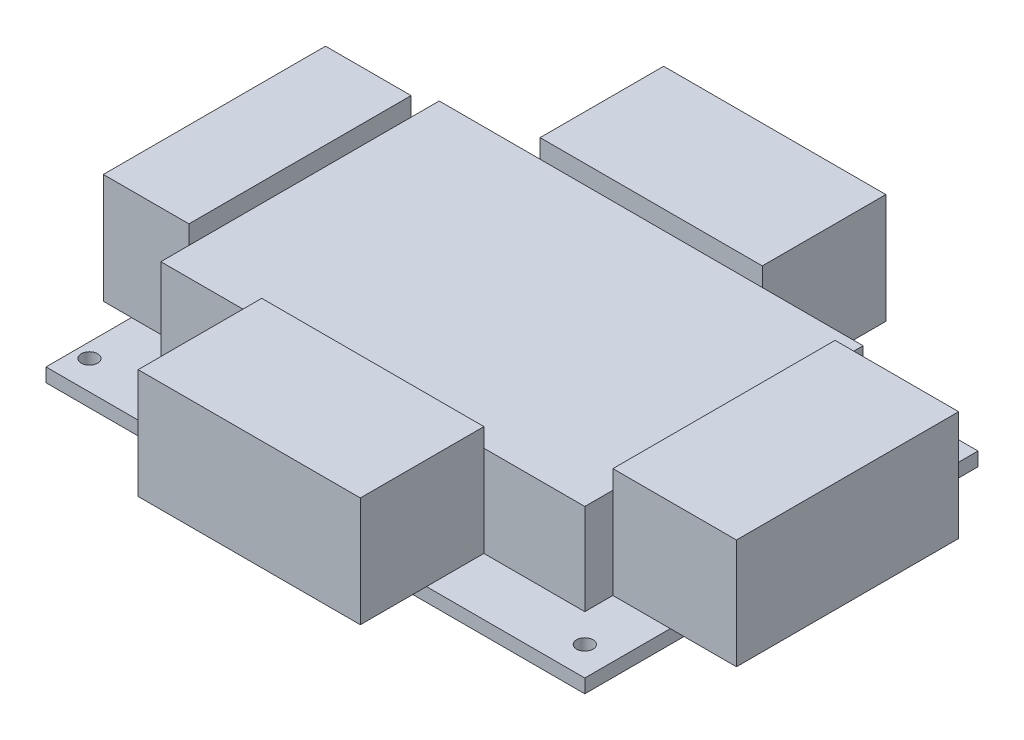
ISO-10303-21;
HEADER;
FILE_DESCRIPTION(('STEP AP214'),'2;1');
FILE_NAME('part.step','',(''),(''),'','','');
FILE_SCHEMA(('AUTOMOTIVE_DESIGN { 1 0 10303 214 1 1 1 1 }'));
ENDSEC;
DATA;
#1=APPLICATION_CONTEXT('core data for automotive mechanical design processes');
#2=APPLICATION_PROTOCOL_DEFINITION('international standard','automotive_design',2000,#1);
#3=PRODUCT_CONTEXT('',#1,'mechanical');
#4=PRODUCT('Part','Part','',(#3));
#5=PRODUCT_RELATED_PRODUCT_CATEGORY('part','',(#4));
#6=PRODUCT_DEFINITION_FORMATION('','',#4);
#7=PRODUCT_DEFINITION_CONTEXT('part definition',#1,'design');
#8=PRODUCT_DEFINITION('design','',#6,#7);
#9=PRODUCT_DEFINITION_SHAPE('','',#8);
#10=(LENGTH_UNIT() NAMED_UNIT(*) SI_UNIT(.MILLI.,.METRE.));
#11=(NAMED_UNIT(*) PLANE_ANGLE_UNIT() SI_UNIT($,.RADIAN.));
#12=(NAMED_UNIT(*) SI_UNIT($,.STERADIAN.) SOLID_ANGLE_UNIT());
#13=UNCERTAINTY_MEASURE_WITH_UNIT(LENGTH_MEASURE(1.E-05),#10,'distance_accuracy_value','');
#14=(GEOMETRIC_REPRESENTATION_CONTEXT(3) GLOBAL_UNCERTAINTY_ASSIGNED_CONTEXT((#13)) GLOBAL_UNIT_ASSIGNED_CONTEXT((#10,
#11,#12)) REPRESENTATION_CONTEXT('',''));
#15=CARTESIAN_POINT('',(0.,0.,0.));
#16=DIRECTION('',(0.,0.,1.));
#17=DIRECTION('',(1.,0.,0.));
#18=AXIS2_PLACEMENT_3D('',#15,#16,#17);
#19=CARTESIAN_POINT('',(0.,2.794,0.));
#20=DIRECTION('',(0.,-1.,0.));
#21=DIRECTION('',(0.,0.,-1.));
#22=AXIS2_PLACEMENT_3D('',#19,#20,#21);
#23=PLANE('',#22);
#24=CARTESIAN_POINT('',(2.92735,2.794,-74.09815));
#25=DIRECTION('',(0.,1.,0.));
#26=DIRECTION('',(0.,0.,1.));
#27=AXIS2_PLACEMENT_3D('',#24,#25,#26);
#28=CIRCLE('',#27,1.67005);
#29=CARTESIAN_POINT('',(2.92735,2.794,-72.4281));
#30=VERTEX_POINT('',#29);
#31=EDGE_CURVE('E433',#30,#30,#28,.T.);
#32=ORIENTED_EDGE('',*,*,#31,.F.);
#33=EDGE_LOOP('',(#32));
#34=FACE_BOUND('',#33,.T.);
#35=DIRECTION('',(0.,0.,1.));
#36=VECTOR('',#35,1.);
#37=CARTESIAN_POINT('',(32.21355,2.794,-68.326));
#38=LINE('',#37,#36);
#39=CARTESIAN_POINT('',(32.21355,2.794,-80.01));
#40=VERTEX_POINT('',#39);
#41=CARTESIAN_POINT('',(32.21355,2.794,-68.326));
#42=VERTEX_POINT('',#41);
#43=EDGE_CURVE('E509',#40,#42,#38,.T.);
#44=ORIENTED_EDGE('',*,*,#43,.F.);
#45=DIRECTION('',(-1.,0.,0.));
#46=VECTOR('',#45,1.);
#47=CARTESIAN_POINT('',(0.,2.794,-80.01));
#48=LINE('',#47,#46);
#49=CARTESIAN_POINT('',(0.,2.794,-80.01));
#50=VERTEX_POINT('',#49);
#51=EDGE_CURVE('E463',#40,#50,#48,.T.);
#52=ORIENTED_EDGE('',*,*,#51,.T.);
#53=DIRECTION('',(0.,0.,1.));
#54=VECTOR('',#53,1.);
#55=CARTESIAN_POINT('',(0.,2.794,0.));
#56=LINE('',#55,#54);
#57=CARTESIAN_POINT('',(0.,2.794,-62.611));
#58=VERTEX_POINT('',#57);
#59=EDGE_CURVE('E451',#50,#58,#56,.T.);
#60=ORIENTED_EDGE('',*,*,#59,.T.);
#61=DIRECTION('',(-1.,0.,0.));
#62=VECTOR('',#61,1.);
#63=CARTESIAN_POINT('',(11.684,2.794,-62.611));
#64=LINE('',#63,#62);
#65=CARTESIAN_POINT('',(11.684,2.794,-62.611));
#66=VERTEX_POINT('',#65);
#67=EDGE_CURVE('E286',#66,#58,#64,.T.);
#68=ORIENTED_EDGE('',*,*,#67,.F.);
#69=DIRECTION('',(0.,0.,1.));
#70=VECTOR('',#69,1.);
#71=CARTESIAN_POINT('',(11.684,2.794,-11.684));
#72=LINE('',#71,#70);
#73=CARTESIAN_POINT('',(11.684,2.794,-68.326));
#74=VERTEX_POINT('',#73);
#75=EDGE_CURVE('E400',#74,#66,#72,.T.);
#76=ORIENTED_EDGE('',*,*,#75,.F.);
#77=DIRECTION('',(-1.,0.,0.));
#78=VECTOR('',#77,1.);
#79=CARTESIAN_POINT('',(11.684,2.794,-68.326));
#80=LINE('',#79,#78);
#81=EDGE_CURVE('E411',#42,#74,#80,.T.);
#82=ORIENTED_EDGE('',*,*,#81,.F.);
#83=EDGE_LOOP('',(#44,#52,#60,#68,#76,#82));
#84=FACE_BOUND('',#83,.T.);
#85=ADVANCED_FACE('F35',(#34,#84),#23,.F.);
#86=CARTESIAN_POINT('',(103.72725,2.794,-74.09815));
#87=DIRECTION('',(0.,1.,0.));
#88=DIRECTION('',(0.,0.,1.));
#89=AXIS2_PLACEMENT_3D('',#86,#87,#88);
#90=CIRCLE('',#89,1.67005000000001);
#91=CARTESIAN_POINT('',(103.72725,2.794,-72.4281));
#92=VERTEX_POINT('',#91);
#93=EDGE_CURVE('E439',#92,#92,#90,.T.);
#94=ORIENTED_EDGE('',*,*,#93,.F.);
#95=EDGE_LOOP('',(#94));
#96=FACE_BOUND('',#95,.T.);
#97=DIRECTION('',(0.,0.,-1.));
#98=VECTOR('',#97,1.);
#99=CARTESIAN_POINT('',(77.42555,2.794,-68.326));
#100=LINE('',#99,#98);
#101=CARTESIAN_POINT('',(77.42555,2.794,-68.326));
#102=VERTEX_POINT('',#101);
#103=CARTESIAN_POINT('',(77.42555,2.794,-80.01));
#104=VERTEX_POINT('',#103);
#105=EDGE_CURVE('E517',#102,#104,#100,.T.);
#106=ORIENTED_EDGE('',*,*,#105,.F.);
#107=CARTESIAN_POINT('',(97.9551,2.794,-68.326));
#108=VERTEX_POINT('',#107);
#109=EDGE_CURVE('E412',#108,#102,#80,.T.);
#110=ORIENTED_EDGE('',*,*,#109,.F.);
#111=DIRECTION('',(0.,0.,-1.));
#112=VECTOR('',#111,1.);
#113=CARTESIAN_POINT('',(97.9551,2.794,-11.684));
#114=LINE('',#113,#112);
#115=CARTESIAN_POINT('',(97.9551,2.794,-62.611));
#116=VERTEX_POINT('',#115);
#117=EDGE_CURVE('E407',#116,#108,#114,.T.);
#118=ORIENTED_EDGE('',*,*,#117,.F.);
#119=DIRECTION('',(-1.,0.,0.));
#120=VECTOR('',#119,1.);
#121=CARTESIAN_POINT('',(123.1011,2.794,-62.611));
#122=LINE('',#121,#120);
#123=CARTESIAN_POINT('',(109.6391,2.794,-62.611));
#124=VERTEX_POINT('',#123);
#125=EDGE_CURVE('E356',#124,#116,#122,.T.);
#126=ORIENTED_EDGE('',*,*,#125,.F.);
#127=DIRECTION('',(0.,0.,-1.));
#128=VECTOR('',#127,1.);
#129=CARTESIAN_POINT('',(109.6391,2.794,0.));
#130=LINE('',#129,#128);
#131=CARTESIAN_POINT('',(109.6391,2.794,-80.01));
#132=VERTEX_POINT('',#131);
#133=EDGE_CURVE('E459',#124,#132,#130,.T.);
#134=ORIENTED_EDGE('',*,*,#133,.T.);
#135=EDGE_CURVE('E464',#132,#104,#48,.T.);
#136=ORIENTED_EDGE('',*,*,#135,.T.);
#137=EDGE_LOOP('',(#106,#110,#118,#126,#134,#136));
#138=FACE_BOUND('',#137,.T.);
#139=ADVANCED_FACE('F514',(#96,#138),#23,.F.);
#140=CARTESIAN_POINT('',(11.684,21.336,-68.326));
#141=DIRECTION('',(0.,0.,1.));
#142=DIRECTION('',(1.,0.,0.));
#143=AXIS2_PLACEMENT_3D('',#140,#141,#142);
#144=PLANE('',#143);
#145=DIRECTION('',(0.,-1.,0.));
#146=VECTOR('',#145,1.);
#147=CARTESIAN_POINT('',(32.21355,25.146,-68.326));
#148=LINE('',#147,#146);
#149=CARTESIAN_POINT('',(32.21355,21.336,-68.326));
#150=VERTEX_POINT('',#149);
#151=EDGE_CURVE('E265',#150,#42,#148,.T.);
#152=ORIENTED_EDGE('',*,*,#151,.T.);
#153=ORIENTED_EDGE('',*,*,#81,.T.);
#154=DIRECTION('',(0.,-1.,0.));
#155=VECTOR('',#154,1.);
#156=CARTESIAN_POINT('',(11.684,21.336,-68.326));
#157=LINE('',#156,#155);
#158=CARTESIAN_POINT('',(11.684,21.336,-68.326));
#159=VERTEX_POINT('',#158);
#160=EDGE_CURVE('E398',#159,#74,#157,.T.);
#161=ORIENTED_EDGE('',*,*,#160,.F.);
#162=DIRECTION('',(-1.,0.,0.));
#163=VECTOR('',#162,1.);
#164=CARTESIAN_POINT('',(11.684,21.336,-68.326));
#165=LINE('',#164,#163);
#166=EDGE_CURVE('E393',#150,#159,#165,.T.);
#167=ORIENTED_EDGE('',*,*,#166,.F.);
#168=EDGE_LOOP('',(#152,#153,#161,#167));
#169=FACE_BOUND('',#168,.T.);
#170=ADVANCED_FACE('F561',(#169),#144,.F.);
#171=DIRECTION('',(0.,-1.,0.));
#172=VECTOR('',#171,1.);
#173=CARTESIAN_POINT('',(77.42555,25.146,-68.326));
#174=LINE('',#173,#172);
#175=CARTESIAN_POINT('',(77.42555,21.336,-68.326));
#176=VERTEX_POINT('',#175);
#177=EDGE_CURVE('E567',#176,#102,#174,.T.);
#178=ORIENTED_EDGE('',*,*,#177,.F.);
#179=CARTESIAN_POINT('',(97.9551,21.336,-68.326));
#180=VERTEX_POINT('',#179);
#181=EDGE_CURVE('E395',#180,#176,#165,.T.);
#182=ORIENTED_EDGE('',*,*,#181,.F.);
#183=DIRECTION('',(0.,-1.,0.));
#184=VECTOR('',#183,1.);
#185=CARTESIAN_POINT('',(97.9551,21.336,-68.326));
#186=LINE('',#185,#184);
#187=EDGE_CURVE('E417',#180,#108,#186,.T.);
#188=ORIENTED_EDGE('',*,*,#187,.T.);
#189=ORIENTED_EDGE('',*,*,#109,.T.);
#190=EDGE_LOOP('',(#178,#182,#188,#189));
#191=FACE_BOUND('',#190,.T.);
#192=ADVANCED_FACE('F570',(#191),#144,.F.);
#193=CARTESIAN_POINT('',(2.92735,2.794,-5.91185000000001));
#194=DIRECTION('',(0.,1.,0.));
#195=DIRECTION('',(0.,0.,1.));
#196=AXIS2_PLACEMENT_3D('',#193,#194,#195);
#197=CIRCLE('',#196,1.67005);
#198=CARTESIAN_POINT('',(2.92735,2.794,-4.24180000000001));
#199=VERTEX_POINT('',#198);
#200=EDGE_CURVE('E427',#199,#199,#197,.T.);
#201=ORIENTED_EDGE('',*,*,#200,.F.);
#202=EDGE_LOOP('',(#201));
#203=FACE_BOUND('',#202,.T.);
#204=DIRECTION('',(1.,0.,0.));
#205=VECTOR('',#204,1.);
#206=CARTESIAN_POINT('',(11.684,2.794,-17.399));
#207=LINE('',#206,#205);
#208=CARTESIAN_POINT('',(0.,2.794,-17.399));
#209=VERTEX_POINT('',#208);
#210=CARTESIAN_POINT('',(11.684,2.794,-17.399));
#211=VERTEX_POINT('',#210);
#212=EDGE_CURVE('E291',#209,#211,#207,.T.);
#213=ORIENTED_EDGE('',*,*,#212,.F.);
#214=CARTESIAN_POINT('',(0.,2.794,0.));
#215=VERTEX_POINT('',#214);
#216=EDGE_CURVE('E455',#209,#215,#56,.T.);
#217=ORIENTED_EDGE('',*,*,#216,.T.);
#218=DIRECTION('',(1.,0.,0.));
#219=VECTOR('',#218,1.);
#220=CARTESIAN_POINT('',(0.,2.794,0.));
#221=LINE('',#220,#219);
#222=CARTESIAN_POINT('',(32.21355,2.794,0.));
#223=VERTEX_POINT('',#222);
#224=EDGE_CURVE('E456',#215,#223,#221,.T.);
#225=ORIENTED_EDGE('',*,*,#224,.T.);
#226=DIRECTION('',(0.,0.,1.));
#227=VECTOR('',#226,1.);
#228=CARTESIAN_POINT('',(32.21355,2.794,-11.684));
#229=LINE('',#228,#227);
#230=CARTESIAN_POINT('',(32.21355,2.794,-11.684));
#231=VERTEX_POINT('',#230);
#232=EDGE_CURVE('E323',#231,#223,#229,.T.);
#233=ORIENTED_EDGE('',*,*,#232,.F.);
#234=DIRECTION('',(1.,0.,0.));
#235=VECTOR('',#234,1.);
#236=CARTESIAN_POINT('',(11.684,2.794,-11.684));
#237=LINE('',#236,#235);
#238=CARTESIAN_POINT('',(11.684,2.794,-11.684));
#239=VERTEX_POINT('',#238);
#240=EDGE_CURVE('E404',#239,#231,#237,.T.);
#241=ORIENTED_EDGE('',*,*,#240,.F.);
#242=EDGE_CURVE('E378',#211,#239,#72,.T.);
#243=ORIENTED_EDGE('',*,*,#242,.F.);
#244=EDGE_LOOP('',(#213,#217,#225,#233,#241,#243));
#245=FACE_BOUND('',#244,.T.);
#246=ADVANCED_FACE('F535',(#203,#245),#23,.F.);
#247=CARTESIAN_POINT('',(11.684,21.336,-11.684));
#248=DIRECTION('',(1.,0.,0.));
#249=DIRECTION('',(0.,0.,-1.));
#250=AXIS2_PLACEMENT_3D('',#247,#248,#249);
#251=PLANE('',#250);
#252=DIRECTION('',(0.,-1.,0.));
#253=VECTOR('',#252,1.);
#254=CARTESIAN_POINT('',(11.684,25.146,-62.611));
#255=LINE('',#254,#253);
#256=CARTESIAN_POINT('',(11.684,21.336,-62.611));
#257=VERTEX_POINT('',#256);
#258=EDGE_CURVE('E301',#257,#66,#255,.T.);
#259=ORIENTED_EDGE('',*,*,#258,.F.);
#260=DIRECTION('',(0.,0.,1.));
#261=VECTOR('',#260,1.);
#262=CARTESIAN_POINT('',(11.684,21.336,-11.684));
#263=LINE('',#262,#261);
#264=EDGE_CURVE('E379',#159,#257,#263,.T.);
#265=ORIENTED_EDGE('',*,*,#264,.F.);
#266=ORIENTED_EDGE('',*,*,#160,.T.);
#267=ORIENTED_EDGE('',*,*,#75,.T.);
#268=EDGE_LOOP('',(#259,#265,#266,#267));
#269=FACE_BOUND('',#268,.T.);
#270=ADVANCED_FACE('F558',(#269),#251,.F.);
#271=DIRECTION('',(0.,-1.,0.));
#272=VECTOR('',#271,1.);
#273=CARTESIAN_POINT('',(11.684,25.146,-17.399));
#274=LINE('',#273,#272);
#275=CARTESIAN_POINT('',(11.684,21.336,-17.399));
#276=VERTEX_POINT('',#275);
#277=EDGE_CURVE('E285',#276,#211,#274,.T.);
#278=ORIENTED_EDGE('',*,*,#277,.T.);
#279=ORIENTED_EDGE('',*,*,#242,.T.);
#280=DIRECTION('',(0.,-1.,0.));
#281=VECTOR('',#280,1.);
#282=CARTESIAN_POINT('',(11.684,21.336,-11.684));
#283=LINE('',#282,#281);
#284=CARTESIAN_POINT('',(11.684,21.336,-11.684));
#285=VERTEX_POINT('',#284);
#286=EDGE_CURVE('E423',#285,#239,#283,.T.);
#287=ORIENTED_EDGE('',*,*,#286,.F.);
#288=EDGE_CURVE('E384',#276,#285,#263,.T.);
#289=ORIENTED_EDGE('',*,*,#288,.F.);
#290=EDGE_LOOP('',(#278,#279,#287,#289));
#291=FACE_BOUND('',#290,.T.);
#292=ADVANCED_FACE('F544',(#291),#251,.F.);
#293=CARTESIAN_POINT('',(103.72725,2.794,-5.91185000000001));
#294=DIRECTION('',(0.,1.,0.));
#295=DIRECTION('',(0.,0.,1.));
#296=AXIS2_PLACEMENT_3D('',#293,#294,#295);
#297=CIRCLE('',#296,1.67005000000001);
#298=CARTESIAN_POINT('',(103.72725,2.794,-4.2418));
#299=VERTEX_POINT('',#298);
#300=EDGE_CURVE('E445',#299,#299,#297,.T.);
#301=ORIENTED_EDGE('',*,*,#300,.F.);
#302=EDGE_LOOP('',(#301));
#303=FACE_BOUND('',#302,.T.);
#304=DIRECTION('',(0.,0.,-1.));
#305=VECTOR('',#304,1.);
#306=CARTESIAN_POINT('',(77.42555,2.794,-11.684));
#307=LINE('',#306,#305);
#308=CARTESIAN_POINT('',(77.42555,2.794,0.));
#309=VERTEX_POINT('',#308);
#310=CARTESIAN_POINT('',(77.42555,2.794,-11.684));
#311=VERTEX_POINT('',#310);
#312=EDGE_CURVE('E307',#309,#311,#307,.T.);
#313=ORIENTED_EDGE('',*,*,#312,.F.);
#314=CARTESIAN_POINT('',(109.6391,2.794,0.));
#315=VERTEX_POINT('',#314);
#316=EDGE_CURVE('E454',#309,#315,#221,.T.);
#317=ORIENTED_EDGE('',*,*,#316,.T.);
#318=CARTESIAN_POINT('',(109.6391,2.794,-17.399));
#319=VERTEX_POINT('',#318);
#320=EDGE_CURVE('E460',#315,#319,#130,.T.);
#321=ORIENTED_EDGE('',*,*,#320,.T.);
#322=DIRECTION('',(1.,0.,0.));
#323=VECTOR('',#322,1.);
#324=CARTESIAN_POINT('',(123.1011,2.794,-17.399));
#325=LINE('',#324,#323);
#326=CARTESIAN_POINT('',(97.9551,2.794,-17.399));
#327=VERTEX_POINT('',#326);
#328=EDGE_CURVE('E347',#327,#319,#325,.T.);
#329=ORIENTED_EDGE('',*,*,#328,.F.);
#330=CARTESIAN_POINT('',(97.9551,2.794,-11.684));
#331=VERTEX_POINT('',#330);
#332=EDGE_CURVE('E408',#331,#327,#114,.T.);
#333=ORIENTED_EDGE('',*,*,#332,.F.);
#334=EDGE_CURVE('E403',#311,#331,#237,.T.);
#335=ORIENTED_EDGE('',*,*,#334,.F.);
#336=EDGE_LOOP('',(#313,#317,#321,#329,#333,#335));
#337=FACE_BOUND('',#336,.T.);
#338=ADVANCED_FACE('F525',(#303,#337),#23,.F.);
#339=CARTESIAN_POINT('',(11.684,21.336,-11.684));
#340=DIRECTION('',(0.,0.,-1.));
#341=DIRECTION('',(-1.,0.,0.));
#342=AXIS2_PLACEMENT_3D('',#339,#340,#341);
#343=PLANE('',#342);
#344=DIRECTION('',(0.,-1.,0.));
#345=VECTOR('',#344,1.);
#346=CARTESIAN_POINT('',(77.42555,25.146,-11.684));
#347=LINE('',#346,#345);
#348=CARTESIAN_POINT('',(77.42555,21.336,-11.684));
#349=VERTEX_POINT('',#348);
#350=EDGE_CURVE('E336',#349,#311,#347,.T.);
#351=ORIENTED_EDGE('',*,*,#350,.T.);
#352=ORIENTED_EDGE('',*,*,#334,.T.);
#353=DIRECTION('',(0.,-1.,0.));
#354=VECTOR('',#353,1.);
#355=CARTESIAN_POINT('',(97.9551,21.336,-11.684));
#356=LINE('',#355,#354);
#357=CARTESIAN_POINT('',(97.9551,21.336,-11.684));
#358=VERTEX_POINT('',#357);
#359=EDGE_CURVE('E420',#358,#331,#356,.T.);
#360=ORIENTED_EDGE('',*,*,#359,.F.);
#361=DIRECTION('',(1.,0.,0.));
#362=VECTOR('',#361,1.);
#363=CARTESIAN_POINT('',(11.684,21.336,-11.684));
#364=LINE('',#363,#362);
#365=EDGE_CURVE('E382',#349,#358,#364,.T.);
#366=ORIENTED_EDGE('',*,*,#365,.F.);
#367=EDGE_LOOP('',(#351,#352,#360,#366));
#368=FACE_BOUND('',#367,.T.);
#369=ADVANCED_FACE('F609',(#368),#343,.F.);
#370=DIRECTION('',(0.,-1.,0.));
#371=VECTOR('',#370,1.);
#372=CARTESIAN_POINT('',(32.21355,25.146,-11.684));
#373=LINE('',#372,#371);
#374=CARTESIAN_POINT('',(32.21355,21.336,-11.684));
#375=VERTEX_POINT('',#374);
#376=EDGE_CURVE('E332',#375,#231,#373,.T.);
#377=ORIENTED_EDGE('',*,*,#376,.F.);
#378=EDGE_CURVE('E385',#285,#375,#364,.T.);
#379=ORIENTED_EDGE('',*,*,#378,.F.);
#380=ORIENTED_EDGE('',*,*,#286,.T.);
#381=ORIENTED_EDGE('',*,*,#240,.T.);
#382=EDGE_LOOP('',(#377,#379,#380,#381));
#383=FACE_BOUND('',#382,.T.);
#384=ADVANCED_FACE('F615',(#383),#343,.F.);
#385=CARTESIAN_POINT('',(97.9551,21.336,-11.684));
#386=DIRECTION('',(-1.,0.,0.));
#387=DIRECTION('',(0.,0.,1.));
#388=AXIS2_PLACEMENT_3D('',#385,#386,#387);
#389=PLANE('',#388);
#390=DIRECTION('',(0.,-1.,0.));
#391=VECTOR('',#390,1.);
#392=CARTESIAN_POINT('',(97.9551,25.146,-62.611));
#393=LINE('',#392,#391);
#394=CARTESIAN_POINT('',(97.9551,21.336,-62.611));
#395=VERTEX_POINT('',#394);
#396=EDGE_CURVE('E369',#395,#116,#393,.T.);
#397=ORIENTED_EDGE('',*,*,#396,.T.);
#398=ORIENTED_EDGE('',*,*,#117,.T.);
#399=ORIENTED_EDGE('',*,*,#187,.F.);
#400=DIRECTION('',(0.,0.,-1.));
#401=VECTOR('',#400,1.);
#402=CARTESIAN_POINT('',(97.9551,21.336,-11.684));
#403=LINE('',#402,#401);
#404=EDGE_CURVE('E388',#395,#180,#403,.T.);
#405=ORIENTED_EDGE('',*,*,#404,.F.);
#406=EDGE_LOOP('',(#397,#398,#399,#405));
#407=FACE_BOUND('',#406,.T.);
#408=ADVANCED_FACE('F643',(#407),#389,.F.);
#409=DIRECTION('',(0.,-1.,0.));
#410=VECTOR('',#409,1.);
#411=CARTESIAN_POINT('',(97.9551,25.146,-17.399));
#412=LINE('',#411,#410);
#413=CARTESIAN_POINT('',(97.9551,21.336,-17.399));
#414=VERTEX_POINT('',#413);
#415=EDGE_CURVE('E365',#414,#327,#412,.T.);
#416=ORIENTED_EDGE('',*,*,#415,.F.);
#417=EDGE_CURVE('E390',#358,#414,#403,.T.);
#418=ORIENTED_EDGE('',*,*,#417,.F.);
#419=ORIENTED_EDGE('',*,*,#359,.T.);
#420=ORIENTED_EDGE('',*,*,#332,.T.);
#421=EDGE_LOOP('',(#416,#418,#419,#420));
#422=FACE_BOUND('',#421,.T.);
#423=ADVANCED_FACE('F637',(#422),#389,.F.);
#424=CARTESIAN_POINT('',(0.,0.,0.));
#425=DIRECTION('',(0.,-1.,0.));
#426=DIRECTION('',(0.,0.,-1.));
#427=AXIS2_PLACEMENT_3D('',#424,#425,#426);
#428=PLANE('',#427);
#429=CARTESIAN_POINT('',(2.92735,0.,-74.09815));
#430=DIRECTION('',(0.,1.,0.));
#431=DIRECTION('',(0.,0.,1.));
#432=AXIS2_PLACEMENT_3D('',#429,#430,#431);
#433=CIRCLE('',#432,1.67005);
#434=CARTESIAN_POINT('',(2.92735,0.,-72.4281));
#435=VERTEX_POINT('',#434);
#436=EDGE_CURVE('E430',#435,#435,#433,.T.);
#437=ORIENTED_EDGE('',*,*,#436,.T.);
#438=EDGE_LOOP('',(#437));
#439=FACE_BOUND('',#438,.T.);
#440=CARTESIAN_POINT('',(103.72725,0.,-5.91185000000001));
#441=DIRECTION('',(0.,1.,0.));
#442=DIRECTION('',(0.,0.,1.));
#443=AXIS2_PLACEMENT_3D('',#440,#441,#442);
#444=CIRCLE('',#443,1.67005000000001);
#445=CARTESIAN_POINT('',(103.72725,0.,-4.2418));
#446=VERTEX_POINT('',#445);
#447=EDGE_CURVE('E442',#446,#446,#444,.T.);
#448=ORIENTED_EDGE('',*,*,#447,.T.);
#449=EDGE_LOOP('',(#448));
#450=FACE_BOUND('',#449,.T.);
#451=DIRECTION('',(0.,0.,1.));
#452=VECTOR('',#451,1.);
#453=CARTESIAN_POINT('',(0.,0.,0.));
#454=LINE('',#453,#452);
#455=CARTESIAN_POINT('',(0.,0.,-80.01));
#456=VERTEX_POINT('',#455);
#457=CARTESIAN_POINT('',(0.,0.,0.));
#458=VERTEX_POINT('',#457);
#459=EDGE_CURVE('E448',#456,#458,#454,.T.);
#460=ORIENTED_EDGE('',*,*,#459,.F.);
#461=DIRECTION('',(-1.,0.,0.));
#462=VECTOR('',#461,1.);
#463=CARTESIAN_POINT('',(0.,0.,-80.01));
#464=LINE('',#463,#462);
#465=CARTESIAN_POINT('',(109.6391,0.,-80.01));
#466=VERTEX_POINT('',#465);
#467=EDGE_CURVE('E474',#466,#456,#464,.T.);
#468=ORIENTED_EDGE('',*,*,#467,.F.);
#469=DIRECTION('',(0.,0.,-1.));
#470=VECTOR('',#469,1.);
#471=CARTESIAN_POINT('',(109.6391,0.,0.));
#472=LINE('',#471,#470);
#473=CARTESIAN_POINT('',(109.6391,0.,0.));
#474=VERTEX_POINT('',#473);
#475=EDGE_CURVE('E472',#474,#466,#472,.T.);
#476=ORIENTED_EDGE('',*,*,#475,.F.);
#477=DIRECTION('',(1.,0.,0.));
#478=VECTOR('',#477,1.);
#479=CARTESIAN_POINT('',(0.,0.,0.));
#480=LINE('',#479,#478);
#481=EDGE_CURVE('E470',#458,#474,#480,.T.);
#482=ORIENTED_EDGE('',*,*,#481,.F.);
#483=EDGE_LOOP('',(#460,#468,#476,#482));
#484=FACE_BOUND('',#483,.T.);
#485=CARTESIAN_POINT('',(103.72725,0.,-74.09815));
#486=DIRECTION('',(0.,1.,0.));
#487=DIRECTION('',(0.,0.,1.));
#488=AXIS2_PLACEMENT_3D('',#485,#486,#487);
#489=CIRCLE('',#488,1.67005000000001);
#490=CARTESIAN_POINT('',(103.72725,0.,-72.4281));
#491=VERTEX_POINT('',#490);
#492=EDGE_CURVE('E436',#491,#491,#489,.T.);
#493=ORIENTED_EDGE('',*,*,#492,.T.);
#494=EDGE_LOOP('',(#493));
#495=FACE_BOUND('',#494,.T.);
#496=CARTESIAN_POINT('',(2.92735,0.,-5.91185000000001));
#497=DIRECTION('',(0.,1.,0.));
#498=DIRECTION('',(0.,0.,1.));
#499=AXIS2_PLACEMENT_3D('',#496,#497,#498);
#500=CIRCLE('',#499,1.67005);
#501=CARTESIAN_POINT('',(2.92735,0.,-4.24180000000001));
#502=VERTEX_POINT('',#501);
#503=EDGE_CURVE('E426',#502,#502,#500,.T.);
#504=ORIENTED_EDGE('',*,*,#503,.T.);
#505=EDGE_LOOP('',(#504));
#506=FACE_BOUND('',#505,.T.);
#507=ADVANCED_FACE('F492',(#439,#450,#484,#495,#506),#428,.T.);
#508=CARTESIAN_POINT('',(0.,2.794,0.));
#509=DIRECTION('',(1.,0.,0.));
#510=DIRECTION('',(0.,0.,-1.));
#511=AXIS2_PLACEMENT_3D('',#508,#509,#510);
#512=PLANE('',#511);
#513=ORIENTED_EDGE('',*,*,#459,.T.);
#514=DIRECTION('',(0.,-1.,0.));
#515=VECTOR('',#514,1.);
#516=CARTESIAN_POINT('',(0.,2.794,0.));
#517=LINE('',#516,#515);
#518=EDGE_CURVE('E11',#215,#458,#517,.T.);
#519=ORIENTED_EDGE('',*,*,#518,.F.);
#520=ORIENTED_EDGE('',*,*,#216,.F.);
#521=DIRECTION('',(0.,0.,1.));
#522=VECTOR('',#521,1.);
#523=CARTESIAN_POINT('',(0.,2.794,0.));
#524=LINE('',#523,#522);
#525=EDGE_CURVE('E305',#58,#209,#524,.T.);
#526=ORIENTED_EDGE('',*,*,#525,.F.);
#527=ORIENTED_EDGE('',*,*,#59,.F.);
#528=DIRECTION('',(0.,-1.,0.));
#529=VECTOR('',#528,1.);
#530=CARTESIAN_POINT('',(0.,2.794,-80.01));
#531=LINE('',#530,#529);
#532=EDGE_CURVE('E467',#50,#456,#531,.T.);
#533=ORIENTED_EDGE('',*,*,#532,.T.);
#534=EDGE_LOOP('',(#513,#519,#520,#526,#527,#533));
#535=FACE_BOUND('',#534,.T.);
#536=ADVANCED_FACE('F37',(#535),#512,.F.);
#537=CARTESIAN_POINT('',(0.,2.794,0.));
#538=DIRECTION('',(0.,0.,-1.));
#539=DIRECTION('',(-1.,0.,0.));
#540=AXIS2_PLACEMENT_3D('',#537,#538,#539);
#541=PLANE('',#540);
#542=ORIENTED_EDGE('',*,*,#481,.T.);
#543=DIRECTION('',(0.,-1.,0.));
#544=VECTOR('',#543,1.);
#545=CARTESIAN_POINT('',(109.6391,2.794,0.));
#546=LINE('',#545,#544);
#547=EDGE_CURVE('E43',#315,#474,#546,.T.);
#548=ORIENTED_EDGE('',*,*,#547,.F.);
#549=ORIENTED_EDGE('',*,*,#316,.F.);
#550=DIRECTION('',(-1.,0.,0.));
#551=VECTOR('',#550,1.);
#552=CARTESIAN_POINT('',(0.,2.794,0.));
#553=LINE('',#552,#551);
#554=EDGE_CURVE('E339',#309,#223,#553,.T.);
#555=ORIENTED_EDGE('',*,*,#554,.T.);
#556=ORIENTED_EDGE('',*,*,#224,.F.);
#557=ORIENTED_EDGE('',*,*,#518,.T.);
#558=EDGE_LOOP('',(#542,#548,#549,#555,#556,#557));
#559=FACE_BOUND('',#558,.T.);
#560=ADVANCED_FACE('F528',(#559),#541,.F.);
#561=CARTESIAN_POINT('',(109.6391,2.794,0.));
#562=DIRECTION('',(-1.,0.,0.));
#563=DIRECTION('',(0.,0.,1.));
#564=AXIS2_PLACEMENT_3D('',#561,#562,#563);
#565=PLANE('',#564);
#566=ORIENTED_EDGE('',*,*,#475,.T.);
#567=DIRECTION('',(0.,-1.,0.));
#568=VECTOR('',#567,1.);
#569=CARTESIAN_POINT('',(109.6391,2.794,-80.01));
#570=LINE('',#569,#568);
#571=EDGE_CURVE('E478',#132,#466,#570,.T.);
#572=ORIENTED_EDGE('',*,*,#571,.F.);
#573=ORIENTED_EDGE('',*,*,#133,.F.);
#574=DIRECTION('',(0.,0.,1.));
#575=VECTOR('',#574,1.);
#576=CARTESIAN_POINT('',(109.6391,2.794,0.));
#577=LINE('',#576,#575);
#578=EDGE_CURVE('E375',#124,#319,#577,.T.);
#579=ORIENTED_EDGE('',*,*,#578,.T.);
#580=ORIENTED_EDGE('',*,*,#320,.F.);
#581=ORIENTED_EDGE('',*,*,#547,.T.);
#582=EDGE_LOOP('',(#566,#572,#573,#579,#580,#581));
#583=FACE_BOUND('',#582,.T.);
#584=ADVANCED_FACE('F485',(#583),#565,.F.);
#585=CARTESIAN_POINT('',(0.,2.794,-80.01));
#586=DIRECTION('',(0.,0.,1.));
#587=DIRECTION('',(1.,0.,0.));
#588=AXIS2_PLACEMENT_3D('',#585,#586,#587);
#589=PLANE('',#588);
#590=ORIENTED_EDGE('',*,*,#467,.T.);
#591=ORIENTED_EDGE('',*,*,#532,.F.);
#592=ORIENTED_EDGE('',*,*,#51,.F.);
#593=DIRECTION('',(1.,0.,0.));
#594=VECTOR('',#593,1.);
#595=CARTESIAN_POINT('',(0.,2.794,-80.01));
#596=LINE('',#595,#594);
#597=EDGE_CURVE('E267',#40,#104,#596,.T.);
#598=ORIENTED_EDGE('',*,*,#597,.T.);
#599=ORIENTED_EDGE('',*,*,#135,.F.);
#600=ORIENTED_EDGE('',*,*,#571,.T.);
#601=EDGE_LOOP('',(#590,#591,#592,#598,#599,#600));
#602=FACE_BOUND('',#601,.T.);
#603=ADVANCED_FACE('F496',(#602),#589,.F.);
#604=CARTESIAN_POINT('',(103.72725,2.794,-5.91185000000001));
#605=DIRECTION('',(0.,-1.,0.));
#606=DIRECTION('',(0.,0.,-1.));
#607=AXIS2_PLACEMENT_3D('',#604,#605,#606);
#608=CYLINDRICAL_SURFACE('',#607,1.67005000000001);
#609=ORIENTED_EDGE('',*,*,#300,.T.);
#610=EDGE_LOOP('',(#609));
#611=FACE_BOUND('',#610,.T.);
#612=ORIENTED_EDGE('',*,*,#447,.F.);
#613=EDGE_LOOP('',(#612));
#614=FACE_BOUND('',#613,.T.);
#615=ADVANCED_FACE('F650',(#611,#614),#608,.F.);
#616=CARTESIAN_POINT('',(103.72725,2.794,-74.09815));
#617=DIRECTION('',(0.,-1.,0.));
#618=DIRECTION('',(0.,0.,-1.));
#619=AXIS2_PLACEMENT_3D('',#616,#617,#618);
#620=CYLINDRICAL_SURFACE('',#619,1.67005000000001);
#621=ORIENTED_EDGE('',*,*,#93,.T.);
#622=EDGE_LOOP('',(#621));
#623=FACE_BOUND('',#622,.T.);
#624=ORIENTED_EDGE('',*,*,#492,.F.);
#625=EDGE_LOOP('',(#624));
#626=FACE_BOUND('',#625,.T.);
#627=ADVANCED_FACE('F672',(#623,#626),#620,.F.);
#628=CARTESIAN_POINT('',(2.92735,2.794,-74.09815));
#629=DIRECTION('',(0.,-1.,0.));
#630=DIRECTION('',(0.,0.,-1.));
#631=AXIS2_PLACEMENT_3D('',#628,#629,#630);
#632=CYLINDRICAL_SURFACE('',#631,1.67005);
#633=ORIENTED_EDGE('',*,*,#31,.T.);
#634=EDGE_LOOP('',(#633));
#635=FACE_BOUND('',#634,.T.);
#636=ORIENTED_EDGE('',*,*,#436,.F.);
#637=EDGE_LOOP('',(#636));
#638=FACE_BOUND('',#637,.T.);
#639=ADVANCED_FACE('F632',(#635,#638),#632,.F.);
#640=CARTESIAN_POINT('',(2.92735,2.794,-5.91185000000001));
#641=DIRECTION('',(0.,-1.,0.));
#642=DIRECTION('',(0.,0.,-1.));
#643=AXIS2_PLACEMENT_3D('',#640,#641,#642);
#644=CYLINDRICAL_SURFACE('',#643,1.67005);
#645=ORIENTED_EDGE('',*,*,#200,.T.);
#646=EDGE_LOOP('',(#645));
#647=FACE_BOUND('',#646,.T.);
#648=ORIENTED_EDGE('',*,*,#503,.F.);
#649=EDGE_LOOP('',(#648));
#650=FACE_BOUND('',#649,.T.);
#651=ADVANCED_FACE('F629',(#647,#650),#644,.F.);
#652=CARTESIAN_POINT('',(0.,21.336,0.));
#653=DIRECTION('',(0.,-1.,0.));
#654=DIRECTION('',(0.,0.,-1.));
#655=AXIS2_PLACEMENT_3D('',#652,#653,#654);
#656=PLANE('',#655);
#657=ORIENTED_EDGE('',*,*,#264,.T.);
#658=EDGE_CURVE('E383',#257,#276,#263,.T.);
#659=ORIENTED_EDGE('',*,*,#658,.T.);
#660=ORIENTED_EDGE('',*,*,#288,.T.);
#661=ORIENTED_EDGE('',*,*,#378,.T.);
#662=EDGE_CURVE('E389',#375,#349,#364,.T.);
#663=ORIENTED_EDGE('',*,*,#662,.T.);
#664=ORIENTED_EDGE('',*,*,#365,.T.);
#665=ORIENTED_EDGE('',*,*,#417,.T.);
#666=EDGE_CURVE('E394',#414,#395,#403,.T.);
#667=ORIENTED_EDGE('',*,*,#666,.T.);
#668=ORIENTED_EDGE('',*,*,#404,.T.);
#669=ORIENTED_EDGE('',*,*,#181,.T.);
#670=EDGE_CURVE('E399',#176,#150,#165,.T.);
#671=ORIENTED_EDGE('',*,*,#670,.T.);
#672=ORIENTED_EDGE('',*,*,#166,.T.);
#673=EDGE_LOOP('',(#657,#659,#660,#661,#663,#664,#665,#667,#668,#669,#671,#672));
#674=FACE_BOUND('',#673,.T.);
#675=ADVANCED_FACE('F549',(#674),#656,.F.);
#676=CARTESIAN_POINT('',(0.,2.794,0.));
#677=DIRECTION('',(0.,-1.,0.));
#678=DIRECTION('',(0.,0.,-1.));
#679=AXIS2_PLACEMENT_3D('',#676,#677,#678);
#680=PLANE('',#679);
#681=ORIENTED_EDGE('',*,*,#578,.F.);
#682=CARTESIAN_POINT('',(123.1011,2.794,-62.611));
#683=VERTEX_POINT('',#682);
#684=EDGE_CURVE('E357',#683,#124,#122,.T.);
#685=ORIENTED_EDGE('',*,*,#684,.F.);
#686=DIRECTION('',(0.,0.,-1.));
#687=VECTOR('',#686,1.);
#688=CARTESIAN_POINT('',(123.1011,2.794,-62.611));
#689=LINE('',#688,#687);
#690=CARTESIAN_POINT('',(123.1011,2.794,-17.399));
#691=VERTEX_POINT('',#690);
#692=EDGE_CURVE('E342',#691,#683,#689,.T.);
#693=ORIENTED_EDGE('',*,*,#692,.F.);
#694=EDGE_CURVE('E360',#319,#691,#325,.T.);
#695=ORIENTED_EDGE('',*,*,#694,.F.);
#696=EDGE_LOOP('',(#681,#685,#693,#695));
#697=FACE_BOUND('',#696,.T.);
#698=ADVANCED_FACE('F696',(#697),#680,.T.);
#699=CARTESIAN_POINT('',(97.9551,25.146,-62.611));
#700=DIRECTION('',(1.,0.,0.));
#701=DIRECTION('',(0.,0.,-1.));
#702=AXIS2_PLACEMENT_3D('',#699,#700,#701);
#703=PLANE('',#702);
#704=CARTESIAN_POINT('',(97.9551,25.146,-62.611));
#705=VERTEX_POINT('',#704);
#706=EDGE_CURVE('E370',#705,#395,#393,.T.);
#707=ORIENTED_EDGE('',*,*,#706,.T.);
#708=ORIENTED_EDGE('',*,*,#666,.F.);
#709=CARTESIAN_POINT('',(97.9551,25.146,-17.399));
#710=VERTEX_POINT('',#709);
#711=EDGE_CURVE('E366',#710,#414,#412,.T.);
#712=ORIENTED_EDGE('',*,*,#711,.F.);
#713=DIRECTION('',(0.,0.,1.));
#714=VECTOR('',#713,1.);
#715=CARTESIAN_POINT('',(97.9551,25.146,-62.611));
#716=LINE('',#715,#714);
#717=EDGE_CURVE('E349',#705,#710,#716,.T.);
#718=ORIENTED_EDGE('',*,*,#717,.F.);
#719=EDGE_LOOP('',(#707,#708,#712,#718));
#720=FACE_BOUND('',#719,.T.);
#721=ADVANCED_FACE('F703',(#720),#703,.F.);
#722=CARTESIAN_POINT('',(123.1011,25.146,-62.611));
#723=DIRECTION('',(-1.,0.,0.));
#724=DIRECTION('',(0.,0.,1.));
#725=AXIS2_PLACEMENT_3D('',#722,#723,#724);
#726=PLANE('',#725);
#727=ORIENTED_EDGE('',*,*,#692,.T.);
#728=DIRECTION('',(0.,-1.,0.));
#729=VECTOR('',#728,1.);
#730=CARTESIAN_POINT('',(123.1011,25.146,-62.611));
#731=LINE('',#730,#729);
#732=CARTESIAN_POINT('',(123.1011,25.146,-62.611));
#733=VERTEX_POINT('',#732);
#734=EDGE_CURVE('E372',#733,#683,#731,.T.);
#735=ORIENTED_EDGE('',*,*,#734,.F.);
#736=DIRECTION('',(0.,0.,-1.));
#737=VECTOR('',#736,1.);
#738=CARTESIAN_POINT('',(123.1011,25.146,-62.611));
#739=LINE('',#738,#737);
#740=CARTESIAN_POINT('',(123.1011,25.146,-17.399));
#741=VERTEX_POINT('',#740);
#742=EDGE_CURVE('E343',#741,#733,#739,.T.);
#743=ORIENTED_EDGE('',*,*,#742,.F.);
#744=DIRECTION('',(0.,-1.,0.));
#745=VECTOR('',#744,1.);
#746=CARTESIAN_POINT('',(123.1011,25.146,-17.399));
#747=LINE('',#746,#745);
#748=EDGE_CURVE('E353',#741,#691,#747,.T.);
#749=ORIENTED_EDGE('',*,*,#748,.T.);
#750=EDGE_LOOP('',(#727,#735,#743,#749));
#751=FACE_BOUND('',#750,.T.);
#752=ADVANCED_FACE('F710',(#751),#726,.F.);
#753=CARTESIAN_POINT('',(123.1011,25.146,-62.611));
#754=DIRECTION('',(0.,0.,1.));
#755=DIRECTION('',(1.,0.,0.));
#756=AXIS2_PLACEMENT_3D('',#753,#754,#755);
#757=PLANE('',#756);
#758=ORIENTED_EDGE('',*,*,#684,.T.);
#759=ORIENTED_EDGE('',*,*,#125,.T.);
#760=ORIENTED_EDGE('',*,*,#396,.F.);
#761=ORIENTED_EDGE('',*,*,#706,.F.);
#762=DIRECTION('',(-1.,0.,0.));
#763=VECTOR('',#762,1.);
#764=CARTESIAN_POINT('',(123.1011,25.146,-62.611));
#765=LINE('',#764,#763);
#766=EDGE_CURVE('E346',#733,#705,#765,.T.);
#767=ORIENTED_EDGE('',*,*,#766,.F.);
#768=ORIENTED_EDGE('',*,*,#734,.T.);
#769=EDGE_LOOP('',(#758,#759,#760,#761,#767,#768));
#770=FACE_BOUND('',#769,.T.);
#771=ADVANCED_FACE('F718',(#770),#757,.F.);
#772=CARTESIAN_POINT('',(123.1011,25.146,-17.399));
#773=DIRECTION('',(0.,0.,-1.));
#774=DIRECTION('',(-1.,0.,0.));
#775=AXIS2_PLACEMENT_3D('',#772,#773,#774);
#776=PLANE('',#775);
#777=ORIENTED_EDGE('',*,*,#328,.T.);
#778=ORIENTED_EDGE('',*,*,#694,.T.);
#779=ORIENTED_EDGE('',*,*,#748,.F.);
#780=DIRECTION('',(1.,0.,0.));
#781=VECTOR('',#780,1.);
#782=CARTESIAN_POINT('',(123.1011,25.146,-17.399));
#783=LINE('',#782,#781);
#784=EDGE_CURVE('E351',#710,#741,#783,.T.);
#785=ORIENTED_EDGE('',*,*,#784,.F.);
#786=ORIENTED_EDGE('',*,*,#711,.T.);
#787=ORIENTED_EDGE('',*,*,#415,.T.);
#788=EDGE_LOOP('',(#777,#778,#779,#785,#786,#787));
#789=FACE_BOUND('',#788,.T.);
#790=ADVANCED_FACE('F726',(#789),#776,.F.);
#791=CARTESIAN_POINT('',(0.,25.146,0.));
#792=DIRECTION('',(0.,-1.,0.));
#793=DIRECTION('',(0.,0.,-1.));
#794=AXIS2_PLACEMENT_3D('',#791,#792,#793);
#795=PLANE('',#794);
#796=ORIENTED_EDGE('',*,*,#742,.T.);
#797=ORIENTED_EDGE('',*,*,#766,.T.);
#798=ORIENTED_EDGE('',*,*,#717,.T.);
#799=ORIENTED_EDGE('',*,*,#784,.T.);
#800=EDGE_LOOP('',(#796,#797,#798,#799));
#801=FACE_BOUND('',#800,.T.);
#802=ADVANCED_FACE('F734',(#801),#795,.F.);
#803=CARTESIAN_POINT('',(0.,2.794,0.));
#804=DIRECTION('',(0.,-1.,0.));
#805=DIRECTION('',(0.,0.,-1.));
#806=AXIS2_PLACEMENT_3D('',#803,#804,#805);
#807=PLANE('',#806);
#808=ORIENTED_EDGE('',*,*,#554,.F.);
#809=CARTESIAN_POINT('',(77.42555,2.794,13.462));
#810=VERTEX_POINT('',#809);
#811=EDGE_CURVE('E319',#810,#309,#307,.T.);
#812=ORIENTED_EDGE('',*,*,#811,.F.);
#813=DIRECTION('',(1.,0.,0.));
#814=VECTOR('',#813,1.);
#815=CARTESIAN_POINT('',(77.42555,2.794,13.462));
#816=LINE('',#815,#814);
#817=CARTESIAN_POINT('',(32.21355,2.794,13.462));
#818=VERTEX_POINT('',#817);
#819=EDGE_CURVE('E312',#818,#810,#816,.T.);
#820=ORIENTED_EDGE('',*,*,#819,.F.);
#821=EDGE_CURVE('E322',#223,#818,#229,.T.);
#822=ORIENTED_EDGE('',*,*,#821,.F.);
#823=EDGE_LOOP('',(#808,#812,#820,#822));
#824=FACE_BOUND('',#823,.T.);
#825=ADVANCED_FACE('F742',(#824),#807,.T.);
#826=CARTESIAN_POINT('',(77.42555,25.146,-11.684));
#827=DIRECTION('',(0.,0.,1.));
#828=DIRECTION('',(1.,0.,0.));
#829=AXIS2_PLACEMENT_3D('',#826,#827,#828);
#830=PLANE('',#829);
#831=CARTESIAN_POINT('',(77.42555,25.146,-11.684));
#832=VERTEX_POINT('',#831);
#833=EDGE_CURVE('E337',#832,#349,#347,.T.);
#834=ORIENTED_EDGE('',*,*,#833,.T.);
#835=ORIENTED_EDGE('',*,*,#662,.F.);
#836=CARTESIAN_POINT('',(32.21355,25.146,-11.684));
#837=VERTEX_POINT('',#836);
#838=EDGE_CURVE('E333',#837,#375,#373,.T.);
#839=ORIENTED_EDGE('',*,*,#838,.F.);
#840=DIRECTION('',(-1.,0.,0.));
#841=VECTOR('',#840,1.);
#842=CARTESIAN_POINT('',(77.42555,25.146,-11.684));
#843=LINE('',#842,#841);
#844=EDGE_CURVE('E311',#832,#837,#843,.T.);
#845=ORIENTED_EDGE('',*,*,#844,.F.);
#846=EDGE_LOOP('',(#834,#835,#839,#845));
#847=FACE_BOUND('',#846,.T.);
#848=ADVANCED_FACE('F750',(#847),#830,.F.);
#849=CARTESIAN_POINT('',(77.42555,25.146,-11.684));
#850=DIRECTION('',(-1.,0.,0.));
#851=DIRECTION('',(0.,0.,1.));
#852=AXIS2_PLACEMENT_3D('',#849,#850,#851);
#853=PLANE('',#852);
#854=ORIENTED_EDGE('',*,*,#811,.T.);
#855=ORIENTED_EDGE('',*,*,#312,.T.);
#856=ORIENTED_EDGE('',*,*,#350,.F.);
#857=ORIENTED_EDGE('',*,*,#833,.F.);
#858=DIRECTION('',(0.,0.,-1.));
#859=VECTOR('',#858,1.);
#860=CARTESIAN_POINT('',(77.42555,25.146,-11.684));
#861=LINE('',#860,#859);
#862=CARTESIAN_POINT('',(77.42555,25.146,13.462));
#863=VERTEX_POINT('',#862);
#864=EDGE_CURVE('E308',#863,#832,#861,.T.);
#865=ORIENTED_EDGE('',*,*,#864,.F.);
#866=DIRECTION('',(0.,-1.,0.));
#867=VECTOR('',#866,1.);
#868=CARTESIAN_POINT('',(77.42555,25.146,13.462));
#869=LINE('',#868,#867);
#870=EDGE_CURVE('E318',#863,#810,#869,.T.);
#871=ORIENTED_EDGE('',*,*,#870,.T.);
#872=EDGE_LOOP('',(#854,#855,#856,#857,#865,#871));
#873=FACE_BOUND('',#872,.T.);
#874=ADVANCED_FACE('F757',(#873),#853,.F.);
#875=CARTESIAN_POINT('',(32.21355,25.146,-11.684));
#876=DIRECTION('',(1.,0.,0.));
#877=DIRECTION('',(0.,0.,-1.));
#878=AXIS2_PLACEMENT_3D('',#875,#876,#877);
#879=PLANE('',#878);
#880=ORIENTED_EDGE('',*,*,#232,.T.);
#881=ORIENTED_EDGE('',*,*,#821,.T.);
#882=DIRECTION('',(0.,-1.,0.));
#883=VECTOR('',#882,1.);
#884=CARTESIAN_POINT('',(32.21355,25.146,13.462));
#885=LINE('',#884,#883);
#886=CARTESIAN_POINT('',(32.21355,25.146,13.462));
#887=VERTEX_POINT('',#886);
#888=EDGE_CURVE('E329',#887,#818,#885,.T.);
#889=ORIENTED_EDGE('',*,*,#888,.F.);
#890=DIRECTION('',(0.,0.,1.));
#891=VECTOR('',#890,1.);
#892=CARTESIAN_POINT('',(32.21355,25.146,-11.684));
#893=LINE('',#892,#891);
#894=EDGE_CURVE('E314',#837,#887,#893,.T.);
#895=ORIENTED_EDGE('',*,*,#894,.F.);
#896=ORIENTED_EDGE('',*,*,#838,.T.);
#897=ORIENTED_EDGE('',*,*,#376,.T.);
#898=EDGE_LOOP('',(#880,#881,#889,#895,#896,#897));
#899=FACE_BOUND('',#898,.T.);
#900=ADVANCED_FACE('F765',(#899),#879,.F.);
#901=CARTESIAN_POINT('',(77.42555,25.146,13.462));
#902=DIRECTION('',(0.,0.,-1.));
#903=DIRECTION('',(-1.,0.,0.));
#904=AXIS2_PLACEMENT_3D('',#901,#902,#903);
#905=PLANE('',#904);
#906=ORIENTED_EDGE('',*,*,#819,.T.);
#907=ORIENTED_EDGE('',*,*,#870,.F.);
#908=DIRECTION('',(1.,0.,0.));
#909=VECTOR('',#908,1.);
#910=CARTESIAN_POINT('',(77.42555,25.146,13.462));
#911=LINE('',#910,#909);
#912=EDGE_CURVE('E316',#887,#863,#911,.T.);
#913=ORIENTED_EDGE('',*,*,#912,.F.);
#914=ORIENTED_EDGE('',*,*,#888,.T.);
#915=EDGE_LOOP('',(#906,#907,#913,#914));
#916=FACE_BOUND('',#915,.T.);
#917=ADVANCED_FACE('F773',(#916),#905,.F.);
#918=CARTESIAN_POINT('',(0.,25.146,0.));
#919=DIRECTION('',(0.,-1.,0.));
#920=DIRECTION('',(0.,0.,-1.));
#921=AXIS2_PLACEMENT_3D('',#918,#919,#920);
#922=PLANE('',#921);
#923=ORIENTED_EDGE('',*,*,#864,.T.);
#924=ORIENTED_EDGE('',*,*,#844,.T.);
#925=ORIENTED_EDGE('',*,*,#894,.T.);
#926=ORIENTED_EDGE('',*,*,#912,.T.);
#927=EDGE_LOOP('',(#923,#924,#925,#926));
#928=FACE_BOUND('',#927,.T.);
#929=ADVANCED_FACE('F781',(#928),#922,.F.);
#930=CARTESIAN_POINT('',(0.,2.794,0.));
#931=DIRECTION('',(0.,1.,0.));
#932=DIRECTION('',(0.,0.,1.));
#933=AXIS2_PLACEMENT_3D('',#930,#931,#932);
#934=PLANE('',#933);
#935=CARTESIAN_POINT('',(-5.73012295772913,2.794,-62.611));
#936=VERTEX_POINT('',#935);
#937=EDGE_CURVE('E270',#58,#936,#64,.T.);
#938=ORIENTED_EDGE('',*,*,#937,.F.);
#939=ORIENTED_EDGE('',*,*,#525,.T.);
#940=CARTESIAN_POINT('',(-5.73012295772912,2.794,-17.399));
#941=VERTEX_POINT('',#940);
#942=EDGE_CURVE('E279',#941,#209,#207,.T.);
#943=ORIENTED_EDGE('',*,*,#942,.F.);
#944=DIRECTION('',(0.,0.,1.));
#945=VECTOR('',#944,1.);
#946=CARTESIAN_POINT('',(-5.73012295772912,2.794,-17.399));
#947=LINE('',#946,#945);
#948=EDGE_CURVE('E289',#936,#941,#947,.T.);
#949=ORIENTED_EDGE('',*,*,#948,.F.);
#950=EDGE_LOOP('',(#938,#939,#943,#949));
#951=FACE_BOUND('',#950,.T.);
#952=ADVANCED_FACE('F789',(#951),#934,.F.);
#953=CARTESIAN_POINT('',(11.684,25.146,-17.399));
#954=DIRECTION('',(-1.,0.,0.));
#955=DIRECTION('',(0.,0.,1.));
#956=AXIS2_PLACEMENT_3D('',#953,#954,#955);
#957=PLANE('',#956);
#958=CARTESIAN_POINT('',(11.684,25.146,-17.399));
#959=VERTEX_POINT('',#958);
#960=EDGE_CURVE('E58',#959,#276,#274,.T.);
#961=ORIENTED_EDGE('',*,*,#960,.T.);
#962=ORIENTED_EDGE('',*,*,#658,.F.);
#963=CARTESIAN_POINT('',(11.684,25.146,-62.611));
#964=VERTEX_POINT('',#963);
#965=EDGE_CURVE('E302',#964,#257,#255,.T.);
#966=ORIENTED_EDGE('',*,*,#965,.F.);
#967=DIRECTION('',(0.,0.,-1.));
#968=VECTOR('',#967,1.);
#969=CARTESIAN_POINT('',(11.684,25.146,-17.399));
#970=LINE('',#969,#968);
#971=EDGE_CURVE('E275',#959,#964,#970,.T.);
#972=ORIENTED_EDGE('',*,*,#971,.F.);
#973=EDGE_LOOP('',(#961,#962,#966,#972));
#974=FACE_BOUND('',#973,.T.);
#975=ADVANCED_FACE('F552',(#974),#957,.F.);
#976=CARTESIAN_POINT('',(11.684,25.146,-62.611));
#977=DIRECTION('',(0.,0.,1.));
#978=DIRECTION('',(1.,0.,0.));
#979=AXIS2_PLACEMENT_3D('',#976,#977,#978);
#980=PLANE('',#979);
#981=ORIENTED_EDGE('',*,*,#67,.T.);
#982=ORIENTED_EDGE('',*,*,#937,.T.);
#983=DIRECTION('',(0.,-1.,0.));
#984=VECTOR('',#983,1.);
#985=CARTESIAN_POINT('',(-5.73012295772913,25.146,-62.611));
#986=LINE('',#985,#984);
#987=CARTESIAN_POINT('',(-5.73012295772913,25.146,-62.611));
#988=VERTEX_POINT('',#987);
#989=EDGE_CURVE('E298',#988,#936,#986,.T.);
#990=ORIENTED_EDGE('',*,*,#989,.F.);
#991=DIRECTION('',(-1.,0.,0.));
#992=VECTOR('',#991,1.);
#993=CARTESIAN_POINT('',(11.684,25.146,-62.611));
#994=LINE('',#993,#992);
#995=EDGE_CURVE('E278',#964,#988,#994,.T.);
#996=ORIENTED_EDGE('',*,*,#995,.F.);
#997=ORIENTED_EDGE('',*,*,#965,.T.);
#998=ORIENTED_EDGE('',*,*,#258,.T.);
#999=EDGE_LOOP('',(#981,#982,#990,#996,#997,#998));
#1000=FACE_BOUND('',#999,.T.);
#1001=ADVANCED_FACE('F555',(#1000),#980,.F.);
#1002=CARTESIAN_POINT('',(-5.73012295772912,25.146,-17.399));
#1003=DIRECTION('',(1.,0.,0.));
#1004=DIRECTION('',(0.,0.,-1.));
#1005=AXIS2_PLACEMENT_3D('',#1002,#1003,#1004);
#1006=PLANE('',#1005);
#1007=ORIENTED_EDGE('',*,*,#948,.T.);
#1008=DIRECTION('',(0.,-1.,0.));
#1009=VECTOR('',#1008,1.);
#1010=CARTESIAN_POINT('',(-5.73012295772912,25.146,-17.399));
#1011=LINE('',#1010,#1009);
#1012=CARTESIAN_POINT('',(-5.73012295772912,25.146,-17.399));
#1013=VERTEX_POINT('',#1012);
#1014=EDGE_CURVE('E295',#1013,#941,#1011,.T.);
#1015=ORIENTED_EDGE('',*,*,#1014,.F.);
#1016=DIRECTION('',(0.,0.,1.));
#1017=VECTOR('',#1016,1.);
#1018=CARTESIAN_POINT('',(-5.73012295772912,25.146,-17.399));
#1019=LINE('',#1018,#1017);
#1020=EDGE_CURVE('E281',#988,#1013,#1019,.T.);
#1021=ORIENTED_EDGE('',*,*,#1020,.F.);
#1022=ORIENTED_EDGE('',*,*,#989,.T.);
#1023=EDGE_LOOP('',(#1007,#1015,#1021,#1022));
#1024=FACE_BOUND('',#1023,.T.);
#1025=ADVANCED_FACE('F810',(#1024),#1006,.F.);
#1026=CARTESIAN_POINT('',(11.684,25.146,-17.399));
#1027=DIRECTION('',(0.,0.,-1.));
#1028=DIRECTION('',(-1.,0.,0.));
#1029=AXIS2_PLACEMENT_3D('',#1026,#1027,#1028);
#1030=PLANE('',#1029);
#1031=ORIENTED_EDGE('',*,*,#942,.T.);
#1032=ORIENTED_EDGE('',*,*,#212,.T.);
#1033=ORIENTED_EDGE('',*,*,#277,.F.);
#1034=ORIENTED_EDGE('',*,*,#960,.F.);
#1035=DIRECTION('',(1.,0.,0.));
#1036=VECTOR('',#1035,1.);
#1037=CARTESIAN_POINT('',(11.684,25.146,-17.399));
#1038=LINE('',#1037,#1036);
#1039=EDGE_CURVE('E283',#1013,#959,#1038,.T.);
#1040=ORIENTED_EDGE('',*,*,#1039,.F.);
#1041=ORIENTED_EDGE('',*,*,#1014,.T.);
#1042=EDGE_LOOP('',(#1031,#1032,#1033,#1034,#1040,#1041));
#1043=FACE_BOUND('',#1042,.T.);
#1044=ADVANCED_FACE('F540',(#1043),#1030,.F.);
#1045=CARTESIAN_POINT('',(0.,25.146,0.));
#1046=DIRECTION('',(0.,1.,0.));
#1047=DIRECTION('',(0.,0.,1.));
#1048=AXIS2_PLACEMENT_3D('',#1045,#1046,#1047);
#1049=PLANE('',#1048);
#1050=ORIENTED_EDGE('',*,*,#971,.T.);
#1051=ORIENTED_EDGE('',*,*,#995,.T.);
#1052=ORIENTED_EDGE('',*,*,#1020,.T.);
#1053=ORIENTED_EDGE('',*,*,#1039,.T.);
#1054=EDGE_LOOP('',(#1050,#1051,#1052,#1053));
#1055=FACE_BOUND('',#1054,.T.);
#1056=ADVANCED_FACE('F587',(#1055),#1049,.T.);
#1057=CARTESIAN_POINT('',(0.,2.794,0.));
#1058=DIRECTION('',(0.,-1.,0.));
#1059=DIRECTION('',(0.,0.,-1.));
#1060=AXIS2_PLACEMENT_3D('',#1057,#1058,#1059);
#1061=PLANE('',#1060);
#1062=ORIENTED_EDGE('',*,*,#597,.F.);
#1063=CARTESIAN_POINT('',(32.21355,2.794,-93.472));
#1064=VERTEX_POINT('',#1063);
#1065=EDGE_CURVE('E581',#1064,#40,#38,.T.);
#1066=ORIENTED_EDGE('',*,*,#1065,.F.);
#1067=DIRECTION('',(-1.,0.,0.));
#1068=VECTOR('',#1067,1.);
#1069=CARTESIAN_POINT('',(32.21355,2.794,-93.472));
#1070=LINE('',#1069,#1068);
#1071=CARTESIAN_POINT('',(77.42555,2.794,-93.472));
#1072=VERTEX_POINT('',#1071);
#1073=EDGE_CURVE('E260',#1072,#1064,#1070,.T.);
#1074=ORIENTED_EDGE('',*,*,#1073,.F.);
#1075=EDGE_CURVE('E580',#104,#1072,#100,.T.);
#1076=ORIENTED_EDGE('',*,*,#1075,.F.);
#1077=EDGE_LOOP('',(#1062,#1066,#1074,#1076));
#1078=FACE_BOUND('',#1077,.T.);
#1079=ADVANCED_FACE('F585',(#1078),#1061,.T.);
#1080=CARTESIAN_POINT('',(32.21355,25.146,-68.326));
#1081=DIRECTION('',(0.,0.,-1.));
#1082=DIRECTION('',(-1.,0.,0.));
#1083=AXIS2_PLACEMENT_3D('',#1080,#1081,#1082);
#1084=PLANE('',#1083);
#1085=CARTESIAN_POINT('',(32.21355,25.146,-68.326));
#1086=VERTEX_POINT('',#1085);
#1087=EDGE_CURVE('E50',#1086,#150,#148,.T.);
#1088=ORIENTED_EDGE('',*,*,#1087,.T.);
#1089=ORIENTED_EDGE('',*,*,#670,.F.);
#1090=CARTESIAN_POINT('',(77.42555,25.146,-68.326));
#1091=VERTEX_POINT('',#1090);
#1092=EDGE_CURVE('E247',#1091,#176,#174,.T.);
#1093=ORIENTED_EDGE('',*,*,#1092,.F.);
#1094=DIRECTION('',(1.,0.,0.));
#1095=VECTOR('',#1094,1.);
#1096=CARTESIAN_POINT('',(32.21355,25.146,-68.326));
#1097=LINE('',#1096,#1095);
#1098=EDGE_CURVE('E243',#1086,#1091,#1097,.T.);
#1099=ORIENTED_EDGE('',*,*,#1098,.F.);
#1100=EDGE_LOOP('',(#1088,#1089,#1093,#1099));
#1101=FACE_BOUND('',#1100,.T.);
#1102=ADVANCED_FACE('F245',(#1101),#1084,.F.);
#1103=CARTESIAN_POINT('',(32.21355,25.146,-68.326));
#1104=DIRECTION('',(1.,0.,0.));
#1105=DIRECTION('',(0.,0.,-1.));
#1106=AXIS2_PLACEMENT_3D('',#1103,#1104,#1105);
#1107=PLANE('',#1106);
#1108=ORIENTED_EDGE('',*,*,#1065,.T.);
#1109=ORIENTED_EDGE('',*,*,#43,.T.);
#1110=ORIENTED_EDGE('',*,*,#151,.F.);
#1111=ORIENTED_EDGE('',*,*,#1087,.F.);
#1112=DIRECTION('',(0.,0.,1.));
#1113=VECTOR('',#1112,1.);
#1114=CARTESIAN_POINT('',(32.21355,25.146,-68.326));
#1115=LINE('',#1114,#1113);
#1116=CARTESIAN_POINT('',(32.21355,25.146,-93.472));
#1117=VERTEX_POINT('',#1116);
#1118=EDGE_CURVE('E251',#1117,#1086,#1115,.T.);
#1119=ORIENTED_EDGE('',*,*,#1118,.F.);
#1120=DIRECTION('',(0.,-1.,0.));
#1121=VECTOR('',#1120,1.);
#1122=CARTESIAN_POINT('',(32.21355,25.146,-93.472));
#1123=LINE('',#1122,#1121);
#1124=EDGE_CURVE('E573',#1117,#1064,#1123,.T.);
#1125=ORIENTED_EDGE('',*,*,#1124,.T.);
#1126=EDGE_LOOP('',(#1108,#1109,#1110,#1111,#1119,#1125));
#1127=FACE_BOUND('',#1126,.T.);
#1128=ADVANCED_FACE('F263',(#1127),#1107,.F.);
#1129=CARTESIAN_POINT('',(77.42555,25.146,-68.326));
#1130=DIRECTION('',(-1.,0.,0.));
#1131=DIRECTION('',(0.,0.,1.));
#1132=AXIS2_PLACEMENT_3D('',#1129,#1130,#1131);
#1133=PLANE('',#1132);
#1134=ORIENTED_EDGE('',*,*,#105,.T.);
#1135=ORIENTED_EDGE('',*,*,#1075,.T.);
#1136=DIRECTION('',(0.,-1.,0.));
#1137=VECTOR('',#1136,1.);
#1138=CARTESIAN_POINT('',(77.42555,25.146,-93.472));
#1139=LINE('',#1138,#1137);
#1140=CARTESIAN_POINT('',(77.42555,25.146,-93.472));
#1141=VERTEX_POINT('',#1140);
#1142=EDGE_CURVE('E571',#1141,#1072,#1139,.T.);
#1143=ORIENTED_EDGE('',*,*,#1142,.F.);
#1144=DIRECTION('',(0.,0.,-1.));
#1145=VECTOR('',#1144,1.);
#1146=CARTESIAN_POINT('',(77.42555,25.146,-68.326));
#1147=LINE('',#1146,#1145);
#1148=EDGE_CURVE('E250',#1091,#1141,#1147,.T.);
#1149=ORIENTED_EDGE('',*,*,#1148,.F.);
#1150=ORIENTED_EDGE('',*,*,#1092,.T.);
#1151=ORIENTED_EDGE('',*,*,#177,.T.);
#1152=EDGE_LOOP('',(#1134,#1135,#1143,#1149,#1150,#1151));
#1153=FACE_BOUND('',#1152,.T.);
#1154=ADVANCED_FACE('F566',(#1153),#1133,.F.);
#1155=CARTESIAN_POINT('',(32.21355,25.146,-93.472));
#1156=DIRECTION('',(0.,0.,1.));
#1157=DIRECTION('',(1.,0.,0.));
#1158=AXIS2_PLACEMENT_3D('',#1155,#1156,#1157);
#1159=PLANE('',#1158);
#1160=ORIENTED_EDGE('',*,*,#1073,.T.);
#1161=ORIENTED_EDGE('',*,*,#1124,.F.);
#1162=DIRECTION('',(-1.,0.,0.));
#1163=VECTOR('',#1162,1.);
#1164=CARTESIAN_POINT('',(32.21355,25.146,-93.472));
#1165=LINE('',#1164,#1163);
#1166=EDGE_CURVE('E256',#1141,#1117,#1165,.T.);
#1167=ORIENTED_EDGE('',*,*,#1166,.F.);
#1168=ORIENTED_EDGE('',*,*,#1142,.T.);
#1169=EDGE_LOOP('',(#1160,#1161,#1167,#1168));
#1170=FACE_BOUND('',#1169,.T.);
#1171=ADVANCED_FACE('F584',(#1170),#1159,.F.);
#1172=CARTESIAN_POINT('',(0.,25.146,0.));
#1173=DIRECTION('',(0.,-1.,0.));
#1174=DIRECTION('',(0.,0.,-1.));
#1175=AXIS2_PLACEMENT_3D('',#1172,#1173,#1174);
#1176=PLANE('',#1175);
#1177=ORIENTED_EDGE('',*,*,#1118,.T.);
#1178=ORIENTED_EDGE('',*,*,#1098,.T.);
#1179=ORIENTED_EDGE('',*,*,#1148,.T.);
#1180=ORIENTED_EDGE('',*,*,#1166,.T.);
#1181=EDGE_LOOP('',(#1177,#1178,#1179,#1180));
#1182=FACE_BOUND('',#1181,.T.);
#1183=ADVANCED_FACE('F254',(#1182),#1176,.F.);
#1184=CLOSED_SHELL('',(#85,#139,#170,#192,#246,#270,#292,#338,#369,#384,#408,#423,#507,#536,
#560,#584,#603,#615,#627,#639,#651,#675,#698,#721,#752,#771,#790,#802,#825,#848,#874,#900,#917,
#929,#952,#975,#1001,#1025,#1044,#1056,#1079,#1102,#1128,#1154,#1171,#1183));
#1185=MANIFOLD_SOLID_BREP('B2',#1184);
#1186=ADVANCED_BREP_SHAPE_REPRESENTATION('',(#18,#1185),#14);
#1187=SHAPE_DEFINITION_REPRESENTATION(#9,#1186);
ENDSEC;
END-ISO-10303-21;
